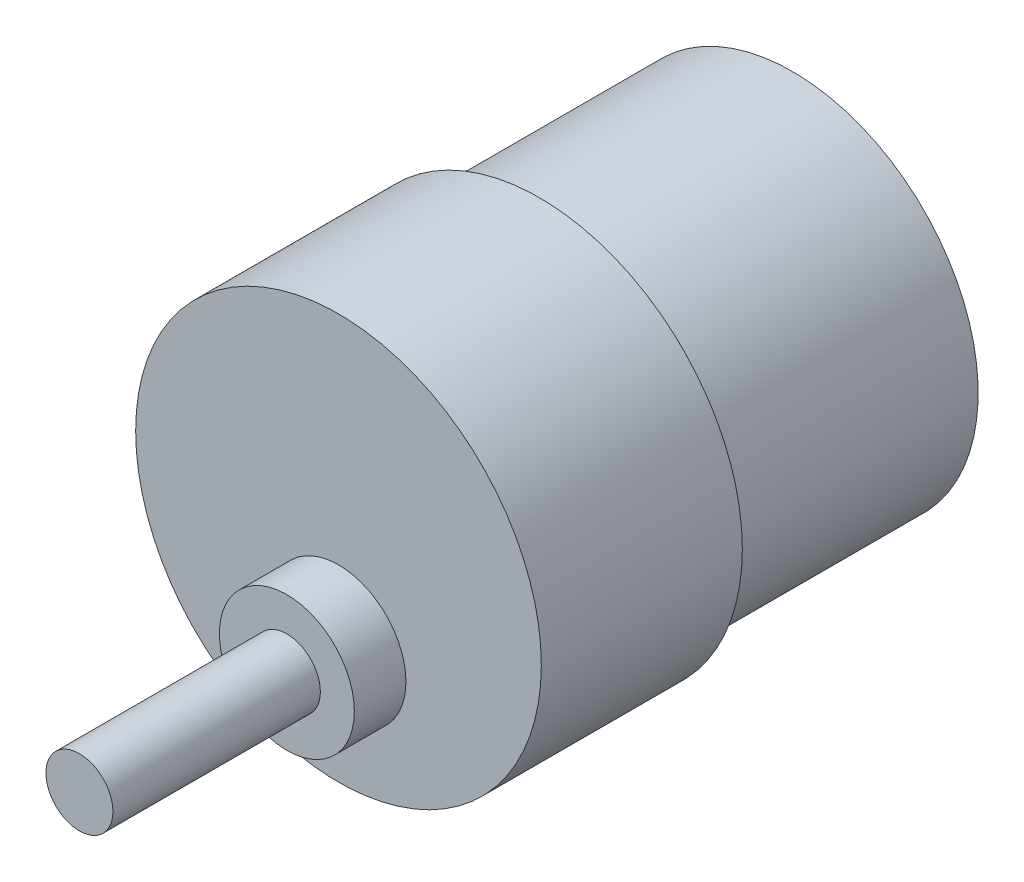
from build123d import *

# Parameters (mm, degrees)
SKETCH1_R           = 16.5735
BOSS_EXTRUDE1_DEPTH = 22.606
SKETCH2_R           = 18.11655
BOSS_EXTRUDE2_DEPTH = 17.9578
SKETCH3_R           = 6.02615
BOSS_EXTRUDE3_DEPTH = 4.6101
SKETCH5_R           = 2.99085
BOSS_EXTRUDE4_DEPTH = 18.5293


with BuildPart() as part:
    # Sketch1 → Boss-Extrude1 (new body)
    with BuildSketch(Plane.XY):
        with Locations(Location((0, 0, 0), (0, 0, 180))):
            Circle(SKETCH1_R)
    extrude(amount=BOSS_EXTRUDE1_DEPTH)

    # Sketch2 → Boss-Extrude2 (add)
    with BuildSketch(Plane.XY.offset(22.606)):
        Circle(SKETCH2_R)
    extrude(amount=BOSS_EXTRUDE2_DEPTH)

    # Sketch3 → Boss-Extrude3 (add)
    with BuildSketch(Plane.XY.offset(40.5638)):
        with Locations((0, -7.3279)):
            Circle(SKETCH3_R)
    extrude(amount=BOSS_EXTRUDE3_DEPTH)

    # Sketch5 → Boss-Extrude4 (add)
    with BuildSketch(Plane.XY.offset(45.1739)):
        with Locations((0, -7.3279)):
            Circle(SKETCH5_R)
    extrude(amount=BOSS_EXTRUDE4_DEPTH)


solid = part.part
